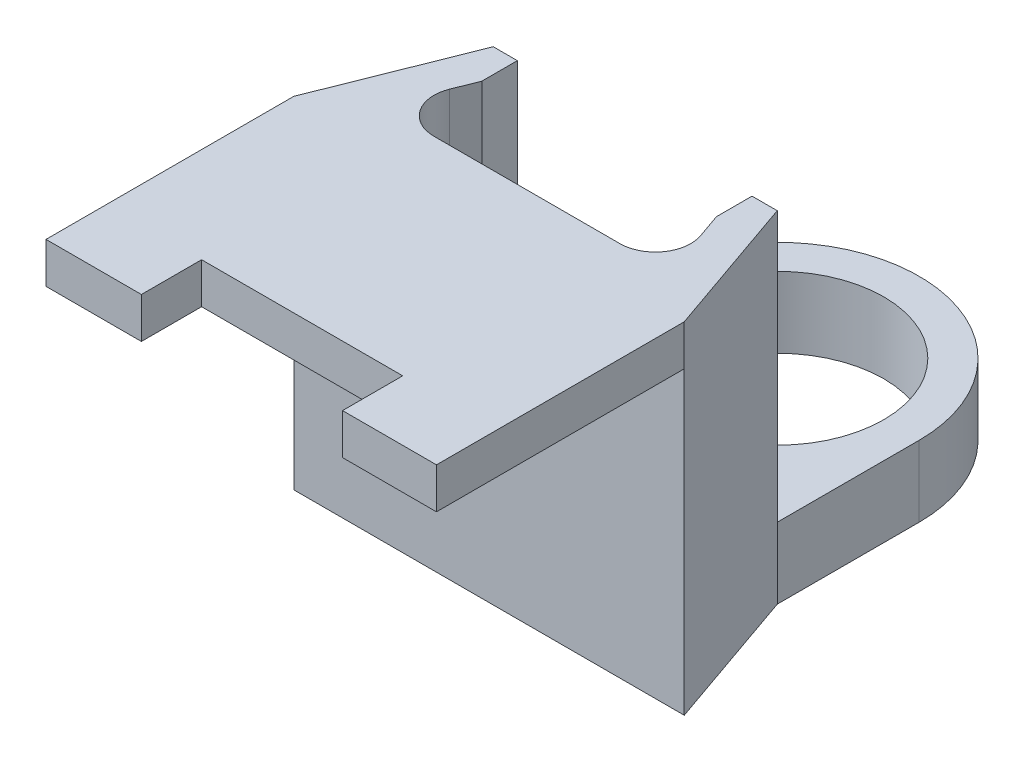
ISO-10303-21;
HEADER;
FILE_DESCRIPTION(('STEP AP214'),'2;1');
FILE_NAME('part.step','',(''),(''),'','','');
FILE_SCHEMA(('AUTOMOTIVE_DESIGN { 1 0 10303 214 1 1 1 1 }'));
ENDSEC;
DATA;
#1=APPLICATION_CONTEXT('core data for automotive mechanical design processes');
#2=APPLICATION_PROTOCOL_DEFINITION('international standard','automotive_design',2000,#1);
#3=PRODUCT_CONTEXT('',#1,'mechanical');
#4=PRODUCT('Part','Part','',(#3));
#5=PRODUCT_RELATED_PRODUCT_CATEGORY('part','',(#4));
#6=PRODUCT_DEFINITION_FORMATION('','',#4);
#7=PRODUCT_DEFINITION_CONTEXT('part definition',#1,'design');
#8=PRODUCT_DEFINITION('design','',#6,#7);
#9=PRODUCT_DEFINITION_SHAPE('','',#8);
#10=(LENGTH_UNIT() NAMED_UNIT(*) SI_UNIT(.MILLI.,.METRE.));
#11=(NAMED_UNIT(*) PLANE_ANGLE_UNIT() SI_UNIT($,.RADIAN.));
#12=(NAMED_UNIT(*) SI_UNIT($,.STERADIAN.) SOLID_ANGLE_UNIT());
#13=UNCERTAINTY_MEASURE_WITH_UNIT(LENGTH_MEASURE(1.E-05),#10,'distance_accuracy_value','');
#14=(GEOMETRIC_REPRESENTATION_CONTEXT(3) GLOBAL_UNCERTAINTY_ASSIGNED_CONTEXT((#13)) GLOBAL_UNIT_ASSIGNED_CONTEXT((#10,
#11,#12)) REPRESENTATION_CONTEXT('',''));
#15=CARTESIAN_POINT('',(0.,0.,0.));
#16=DIRECTION('',(0.,0.,1.));
#17=DIRECTION('',(1.,0.,0.));
#18=AXIS2_PLACEMENT_3D('',#15,#16,#17);
#19=CARTESIAN_POINT('',(47.6155281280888,57.2000000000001,75.));
#20=DIRECTION('',(0.,0.,-1.));
#21=DIRECTION('',(0.,-1.,0.));
#22=AXIS2_PLACEMENT_3D('',#19,#20,#21);
#23=PLANE('',#22);
#24=DIRECTION('',(-1.,0.,0.));
#25=VECTOR('',#24,1.);
#26=CARTESIAN_POINT('',(-27.9999999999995,42.2640722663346,75.));
#27=LINE('',#26,#25);
#28=CARTESIAN_POINT('',(-14.5623007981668,42.2640722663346,75.));
#29=VERTEX_POINT('',#28);
#30=CARTESIAN_POINT('',(-27.9999999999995,42.2640722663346,75.));
#31=VERTEX_POINT('',#30);
#32=EDGE_CURVE('E267',#29,#31,#27,.T.);
#33=ORIENTED_EDGE('',*,*,#32,.F.);
#34=DIRECTION('',(0.,1.,0.));
#35=VECTOR('',#34,1.);
#36=CARTESIAN_POINT('',(-14.5623007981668,-0.001000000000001,75.));
#37=LINE('',#36,#35);
#38=CARTESIAN_POINT('',(-14.5623007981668,48.,75.));
#39=VERTEX_POINT('',#38);
#40=EDGE_CURVE('E249',#29,#39,#37,.T.);
#41=ORIENTED_EDGE('',*,*,#40,.T.);
#42=DIRECTION('',(1.,0.,0.));
#43=VECTOR('',#42,1.);
#44=CARTESIAN_POINT('',(-27.9999999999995,48.,75.));
#45=LINE('',#44,#43);
#46=CARTESIAN_POINT('',(-27.9999999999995,48.,75.));
#47=VERTEX_POINT('',#46);
#48=EDGE_CURVE('E268',#47,#39,#45,.T.);
#49=ORIENTED_EDGE('',*,*,#48,.F.);
#50=DIRECTION('',(0.,1.,0.));
#51=VECTOR('',#50,1.);
#52=CARTESIAN_POINT('',(-27.9999999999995,48.0000000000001,75.));
#53=LINE('',#52,#51);
#54=EDGE_CURVE('E271',#31,#47,#53,.T.);
#55=ORIENTED_EDGE('',*,*,#54,.F.);
#56=EDGE_LOOP('',(#33,#41,#49,#55));
#57=FACE_BOUND('',#56,.T.);
#58=ADVANCED_FACE('F53',(#57),#23,.F.);
#59=CARTESIAN_POINT('',(-20.,48.,20.));
#60=DIRECTION('',(0.,0.,1.));
#61=DIRECTION('',(1.,0.,0.));
#62=AXIS2_PLACEMENT_3D('',#59,#60,#61);
#63=PLANE('',#62);
#64=DIRECTION('',(-1.,0.,0.));
#65=VECTOR('',#64,1.);
#66=CARTESIAN_POINT('',(-20.,10.,20.));
#67=LINE('',#66,#65);
#68=CARTESIAN_POINT('',(20.,10.,20.));
#69=VERTEX_POINT('',#68);
#70=CARTESIAN_POINT('',(16.4467583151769,10.,19.9999999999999));
#71=VERTEX_POINT('',#70);
#72=EDGE_CURVE('E336',#69,#71,#67,.T.);
#73=ORIENTED_EDGE('',*,*,#72,.T.);
#74=DIRECTION('',(0.,1.,0.));
#75=VECTOR('',#74,1.);
#76=CARTESIAN_POINT('',(16.4467583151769,-33.3101923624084,19.9999999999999));
#77=LINE('',#76,#75);
#78=CARTESIAN_POINT('',(16.4467583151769,48.,20.));
#79=VERTEX_POINT('',#78);
#80=EDGE_CURVE('E322',#71,#79,#77,.T.);
#81=ORIENTED_EDGE('',*,*,#80,.T.);
#82=DIRECTION('',(-1.,0.,0.));
#83=VECTOR('',#82,1.);
#84=CARTESIAN_POINT('',(-20.,48.,20.));
#85=LINE('',#84,#83);
#86=CARTESIAN_POINT('',(20.,48.,20.));
#87=VERTEX_POINT('',#86);
#88=EDGE_CURVE('E339',#87,#79,#85,.T.);
#89=ORIENTED_EDGE('',*,*,#88,.F.);
#90=DIRECTION('',(0.,-1.,0.));
#91=VECTOR('',#90,1.);
#92=CARTESIAN_POINT('',(20.,48.,20.));
#93=LINE('',#92,#91);
#94=EDGE_CURVE('E347',#87,#69,#93,.T.);
#95=ORIENTED_EDGE('',*,*,#94,.T.);
#96=EDGE_LOOP('',(#73,#81,#89,#95));
#97=FACE_BOUND('',#96,.T.);
#98=ADVANCED_FACE('F463',(#97),#63,.F.);
#99=CARTESIAN_POINT('',(0.,10.,0.));
#100=DIRECTION('',(0.,-1.,0.));
#101=DIRECTION('',(0.,0.,-1.));
#102=AXIS2_PLACEMENT_3D('',#99,#100,#101);
#103=PLANE('',#102);
#104=CARTESIAN_POINT('',(0.,10.,0.));
#105=DIRECTION('',(0.,1.,0.));
#106=DIRECTION('',(0.,0.,1.));
#107=AXIS2_PLACEMENT_3D('',#104,#105,#106);
#108=CIRCLE('',#107,15.);
#109=CARTESIAN_POINT('',(0.,10.,15.));
#110=VERTEX_POINT('',#109);
#111=EDGE_CURVE('E374',#110,#110,#108,.T.);
#112=ORIENTED_EDGE('',*,*,#111,.F.);
#113=EDGE_LOOP('',(#112));
#114=FACE_BOUND('',#113,.T.);
#115=DIRECTION('',(0.,0.,1.));
#116=VECTOR('',#115,1.);
#117=CARTESIAN_POINT('',(4.91909293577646,10.,0.));
#118=LINE('',#117,#116);
#119=CARTESIAN_POINT('',(4.91909293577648,10.,16.6299617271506));
#120=VERTEX_POINT('',#119);
#121=CARTESIAN_POINT('',(4.91909293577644,10.,25.3001575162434));
#122=VERTEX_POINT('',#121);
#123=EDGE_CURVE('E437',#120,#122,#118,.T.);
#124=ORIENTED_EDGE('',*,*,#123,.T.);
#125=CARTESIAN_POINT('',(14.9190929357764,10.,25.3001575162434));
#126=DIRECTION('',(0.,-1.,0.));
#127=DIRECTION('',(0.,0.,-1.));
#128=AXIS2_PLACEMENT_3D('',#125,#126,#127);
#129=CIRCLE('',#128,10.);
#130=CARTESIAN_POINT('',(12.9283425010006,10.,35.1));
#131=VERTEX_POINT('',#130);
#132=EDGE_CURVE('E418',#122,#131,#129,.F.);
#133=ORIENTED_EDGE('',*,*,#132,.T.);
#134=CARTESIAN_POINT('',(12.9283425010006,10.,30.1));
#135=DIRECTION('',(0.,-1.,0.));
#136=DIRECTION('',(0.,0.,-1.));
#137=AXIS2_PLACEMENT_3D('',#134,#135,#136);
#138=CIRCLE('',#137,5.);
#139=CARTESIAN_POINT('',(17.650192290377,10.,28.455574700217));
#140=VERTEX_POINT('',#139);
#141=EDGE_CURVE('E407',#131,#140,#138,.F.);
#142=ORIENTED_EDGE('',*,*,#141,.T.);
#143=DIRECTION('',(-0.328885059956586,0.,-0.944369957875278));
#144=VECTOR('',#143,1.);
#145=CARTESIAN_POINT('',(19.9641712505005,10.,35.1));
#146=LINE('',#145,#144);
#147=CARTESIAN_POINT('',(16.4467583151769,10.,25.));
#148=VERTEX_POINT('',#147);
#149=EDGE_CURVE('E300',#140,#148,#146,.T.);
#150=ORIENTED_EDGE('',*,*,#149,.T.);
#151=DIRECTION('',(0.,0.,-1.));
#152=VECTOR('',#151,1.);
#153=CARTESIAN_POINT('',(16.4467583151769,10.,25.));
#154=LINE('',#153,#152);
#155=EDGE_CURVE('E319',#148,#71,#154,.T.);
#156=ORIENTED_EDGE('',*,*,#155,.T.);
#157=ORIENTED_EDGE('',*,*,#72,.F.);
#158=DIRECTION('',(0.,0.,-1.));
#159=VECTOR('',#158,1.);
#160=CARTESIAN_POINT('',(20.,10.,-20.));
#161=LINE('',#160,#159);
#162=CARTESIAN_POINT('',(20.,10.,0.));
#163=VERTEX_POINT('',#162);
#164=EDGE_CURVE('E383',#69,#163,#161,.T.);
#165=ORIENTED_EDGE('',*,*,#164,.T.);
#166=CARTESIAN_POINT('',(0.,10.,0.));
#167=DIRECTION('',(0.,1.,0.));
#168=DIRECTION('',(0.,0.,1.));
#169=AXIS2_PLACEMENT_3D('',#166,#167,#168);
#170=CIRCLE('',#169,20.);
#171=CARTESIAN_POINT('',(-20.,10.,0.));
#172=VERTEX_POINT('',#171);
#173=EDGE_CURVE('E366',#163,#172,#170,.T.);
#174=ORIENTED_EDGE('',*,*,#173,.T.);
#175=DIRECTION('',(0.,0.,1.));
#176=VECTOR('',#175,1.);
#177=CARTESIAN_POINT('',(-20.,10.,20.));
#178=LINE('',#177,#176);
#179=CARTESIAN_POINT('',(-20.,10.,20.));
#180=VERTEX_POINT('',#179);
#181=EDGE_CURVE('E380',#172,#180,#178,.T.);
#182=ORIENTED_EDGE('',*,*,#181,.T.);
#183=CARTESIAN_POINT('',(-16.608572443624,10.,20.));
#184=VERTEX_POINT('',#183);
#185=EDGE_CURVE('E313',#184,#180,#67,.T.);
#186=ORIENTED_EDGE('',*,*,#185,.F.);
#187=DIRECTION('',(0.,0.,1.));
#188=VECTOR('',#187,1.);
#189=CARTESIAN_POINT('',(-16.608572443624,10.,25.));
#190=LINE('',#189,#188);
#191=CARTESIAN_POINT('',(-16.608572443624,10.,25.));
#192=VERTEX_POINT('',#191);
#193=EDGE_CURVE('E315',#184,#192,#190,.T.);
#194=ORIENTED_EDGE('',*,*,#193,.T.);
#195=DIRECTION('',(-0.369796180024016,0.,0.929112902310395));
#196=VECTOR('',#195,1.);
#197=CARTESIAN_POINT('',(-16.608572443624,10.,25.));
#198=LINE('',#197,#196);
#199=CARTESIAN_POINT('',(-17.9025103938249,10.,28.2510190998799));
#200=VERTEX_POINT('',#199);
#201=EDGE_CURVE('E310',#192,#200,#198,.T.);
#202=ORIENTED_EDGE('',*,*,#201,.T.);
#203=CARTESIAN_POINT('',(-13.2569458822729,10.,30.1));
#204=DIRECTION('',(0.,-1.,0.));
#205=DIRECTION('',(0.,0.,-1.));
#206=AXIS2_PLACEMENT_3D('',#203,#204,#205);
#207=CIRCLE('',#206,5.);
#208=CARTESIAN_POINT('',(-13.2569458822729,10.,35.1));
#209=VERTEX_POINT('',#208);
#210=EDGE_CURVE('E405',#200,#209,#207,.F.);
#211=ORIENTED_EDGE('',*,*,#210,.T.);
#212=CARTESIAN_POINT('',(-15.0809070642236,10.,25.2677487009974));
#213=DIRECTION('',(0.,-1.,0.));
#214=DIRECTION('',(0.,0.,-1.));
#215=AXIS2_PLACEMENT_3D('',#212,#213,#214);
#216=CIRCLE('',#215,10.);
#217=CARTESIAN_POINT('',(-5.08090706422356,10.,25.2677487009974));
#218=VERTEX_POINT('',#217);
#219=EDGE_CURVE('E74',#209,#218,#216,.F.);
#220=ORIENTED_EDGE('',*,*,#219,.T.);
#221=DIRECTION('',(0.,0.,1.));
#222=VECTOR('',#221,1.);
#223=CARTESIAN_POINT('',(-5.08090706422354,10.,0.));
#224=LINE('',#223,#222);
#225=CARTESIAN_POINT('',(-5.08090706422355,10.,16.6299617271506));
#226=VERTEX_POINT('',#225);
#227=EDGE_CURVE('E438',#226,#218,#224,.T.);
#228=ORIENTED_EDGE('',*,*,#227,.F.);
#229=DIRECTION('',(1.,0.,0.));
#230=VECTOR('',#229,1.);
#231=CARTESIAN_POINT('',(0.,10.,16.6299617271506));
#232=LINE('',#231,#230);
#233=EDGE_CURVE('E245',#226,#120,#232,.T.);
#234=ORIENTED_EDGE('',*,*,#233,.T.);
#235=EDGE_LOOP('',(#124,#133,#142,#150,#156,#157,#165,#174,#182,#186,#194,#202,#211,#220,#228,#234));
#236=FACE_BOUND('',#235,.T.);
#237=ADVANCED_FACE('F444',(#114,#236),#103,.F.);
#238=CARTESIAN_POINT('',(0.,0.,0.));
#239=DIRECTION('',(0.,-1.,0.));
#240=DIRECTION('',(0.,0.,-1.));
#241=AXIS2_PLACEMENT_3D('',#238,#239,#240);
#242=PLANE('',#241);
#243=DIRECTION('',(-0.328885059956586,0.,-0.944369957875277));
#244=VECTOR('',#243,1.);
#245=CARTESIAN_POINT('',(27.0000000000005,0.,40.1));
#246=LINE('',#245,#244);
#247=CARTESIAN_POINT('',(27.0000000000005,0.,40.1));
#248=VERTEX_POINT('',#247);
#249=CARTESIAN_POINT('',(20.,0.,20.));
#250=VERTEX_POINT('',#249);
#251=EDGE_CURVE('E355',#248,#250,#246,.T.);
#252=ORIENTED_EDGE('',*,*,#251,.F.);
#253=DIRECTION('',(1.,0.,0.));
#254=VECTOR('',#253,1.);
#255=CARTESIAN_POINT('',(-27.9999999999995,0.,40.1));
#256=LINE('',#255,#254);
#257=CARTESIAN_POINT('',(-27.9999999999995,0.,40.1));
#258=VERTEX_POINT('',#257);
#259=EDGE_CURVE('E353',#258,#248,#256,.T.);
#260=ORIENTED_EDGE('',*,*,#259,.F.);
#261=DIRECTION('',(-0.369796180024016,0.,0.929112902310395));
#262=VECTOR('',#261,1.);
#263=CARTESIAN_POINT('',(-20.,0.,20.));
#264=LINE('',#263,#262);
#265=CARTESIAN_POINT('',(-20.,0.,20.));
#266=VERTEX_POINT('',#265);
#267=EDGE_CURVE('E350',#266,#258,#264,.T.);
#268=ORIENTED_EDGE('',*,*,#267,.F.);
#269=DIRECTION('',(0.,0.,1.));
#270=VECTOR('',#269,1.);
#271=CARTESIAN_POINT('',(-20.,0.,20.));
#272=LINE('',#271,#270);
#273=CARTESIAN_POINT('',(-20.,0.,0.));
#274=VERTEX_POINT('',#273);
#275=EDGE_CURVE('E377',#274,#266,#272,.T.);
#276=ORIENTED_EDGE('',*,*,#275,.F.);
#277=CARTESIAN_POINT('',(0.,0.,0.));
#278=DIRECTION('',(0.,1.,0.));
#279=DIRECTION('',(0.,0.,1.));
#280=AXIS2_PLACEMENT_3D('',#277,#278,#279);
#281=CIRCLE('',#280,20.);
#282=CARTESIAN_POINT('',(20.,0.,0.));
#283=VERTEX_POINT('',#282);
#284=EDGE_CURVE('E367',#283,#274,#281,.T.);
#285=ORIENTED_EDGE('',*,*,#284,.F.);
#286=DIRECTION('',(0.,0.,-1.));
#287=VECTOR('',#286,1.);
#288=CARTESIAN_POINT('',(20.,0.,-20.));
#289=LINE('',#288,#287);
#290=EDGE_CURVE('E384',#250,#283,#289,.T.);
#291=ORIENTED_EDGE('',*,*,#290,.F.);
#292=EDGE_LOOP('',(#252,#260,#268,#276,#285,#291));
#293=FACE_BOUND('',#292,.T.);
#294=CARTESIAN_POINT('',(0.,0.,0.));
#295=DIRECTION('',(0.,1.,0.));
#296=DIRECTION('',(0.,0.,1.));
#297=AXIS2_PLACEMENT_3D('',#294,#295,#296);
#298=CIRCLE('',#297,15.);
#299=CARTESIAN_POINT('',(0.,0.,15.));
#300=VERTEX_POINT('',#299);
#301=EDGE_CURVE('E373',#300,#300,#298,.T.);
#302=ORIENTED_EDGE('',*,*,#301,.T.);
#303=EDGE_LOOP('',(#302));
#304=FACE_BOUND('',#303,.T.);
#305=ADVANCED_FACE('F477',(#293,#304),#242,.T.);
#306=CARTESIAN_POINT('',(-20.,10.,20.));
#307=DIRECTION('',(1.,0.,0.));
#308=DIRECTION('',(0.,0.,-1.));
#309=AXIS2_PLACEMENT_3D('',#306,#307,#308);
#310=PLANE('',#309);
#311=DIRECTION('',(0.,1.,0.));
#312=VECTOR('',#311,1.);
#313=CARTESIAN_POINT('',(-20.,0.,0.));
#314=LINE('',#313,#312);
#315=EDGE_CURVE('E361',#274,#172,#314,.T.);
#316=ORIENTED_EDGE('',*,*,#315,.F.);
#317=ORIENTED_EDGE('',*,*,#275,.T.);
#318=DIRECTION('',(0.,-1.,0.));
#319=VECTOR('',#318,1.);
#320=CARTESIAN_POINT('',(-20.,10.,20.));
#321=LINE('',#320,#319);
#322=EDGE_CURVE('E392',#180,#266,#321,.T.);
#323=ORIENTED_EDGE('',*,*,#322,.F.);
#324=ORIENTED_EDGE('',*,*,#181,.F.);
#325=EDGE_LOOP('',(#316,#317,#323,#324));
#326=FACE_BOUND('',#325,.T.);
#327=ADVANCED_FACE('F487',(#326),#310,.F.);
#328=CARTESIAN_POINT('',(20.,10.,-20.));
#329=DIRECTION('',(-1.,0.,0.));
#330=DIRECTION('',(0.,0.,1.));
#331=AXIS2_PLACEMENT_3D('',#328,#329,#330);
#332=PLANE('',#331);
#333=ORIENTED_EDGE('',*,*,#290,.T.);
#334=DIRECTION('',(0.,1.,0.));
#335=VECTOR('',#334,1.);
#336=CARTESIAN_POINT('',(20.,0.,0.));
#337=LINE('',#336,#335);
#338=EDGE_CURVE('E369',#283,#163,#337,.T.);
#339=ORIENTED_EDGE('',*,*,#338,.T.);
#340=ORIENTED_EDGE('',*,*,#164,.F.);
#341=DIRECTION('',(0.,-1.,0.));
#342=VECTOR('',#341,1.);
#343=CARTESIAN_POINT('',(20.,10.,20.));
#344=LINE('',#343,#342);
#345=EDGE_CURVE('E387',#69,#250,#344,.T.);
#346=ORIENTED_EDGE('',*,*,#345,.T.);
#347=EDGE_LOOP('',(#333,#339,#340,#346));
#348=FACE_BOUND('',#347,.T.);
#349=ADVANCED_FACE('F468',(#348),#332,.F.);
#350=CARTESIAN_POINT('',(0.,10.,0.));
#351=DIRECTION('',(0.,-1.,0.));
#352=DIRECTION('',(0.,0.,-1.));
#353=AXIS2_PLACEMENT_3D('',#350,#351,#352);
#354=CYLINDRICAL_SURFACE('',#353,15.);
#355=ORIENTED_EDGE('',*,*,#301,.F.);
#356=EDGE_LOOP('',(#355));
#357=FACE_BOUND('',#356,.T.);
#358=ORIENTED_EDGE('',*,*,#111,.T.);
#359=EDGE_LOOP('',(#358));
#360=FACE_BOUND('',#359,.T.);
#361=ADVANCED_FACE('F585',(#357,#360),#354,.F.);
#362=CARTESIAN_POINT('',(0.,0.,0.));
#363=DIRECTION('',(0.,1.,0.));
#364=DIRECTION('',(0.,0.,1.));
#365=AXIS2_PLACEMENT_3D('',#362,#363,#364);
#366=CYLINDRICAL_SURFACE('',#365,20.);
#367=ORIENTED_EDGE('',*,*,#173,.F.);
#368=ORIENTED_EDGE('',*,*,#338,.F.);
#369=ORIENTED_EDGE('',*,*,#284,.T.);
#370=ORIENTED_EDGE('',*,*,#315,.T.);
#371=EDGE_LOOP('',(#367,#368,#369,#370));
#372=FACE_BOUND('',#371,.T.);
#373=ADVANCED_FACE('F484',(#372),#366,.T.);
#374=CARTESIAN_POINT('',(-20.,0.,20.));
#375=DIRECTION('',(-0.929112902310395,0.,-0.369796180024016));
#376=DIRECTION('',(-0.369796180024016,0.,0.929112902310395));
#377=AXIS2_PLACEMENT_3D('',#374,#375,#376);
#378=PLANE('',#377);
#379=DIRECTION('',(0.,1.,0.));
#380=VECTOR('',#379,1.);
#381=CARTESIAN_POINT('',(-27.9999999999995,0.,40.1));
#382=LINE('',#381,#380);
#383=CARTESIAN_POINT('',(-27.9999999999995,42.2640722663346,40.1));
#384=VERTEX_POINT('',#383);
#385=EDGE_CURVE('E358',#258,#384,#382,.T.);
#386=ORIENTED_EDGE('',*,*,#385,.T.);
#387=DIRECTION('',(0.,-1.,0.));
#388=VECTOR('',#387,1.);
#389=CARTESIAN_POINT('',(-27.9999999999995,48.,40.1));
#390=LINE('',#389,#388);
#391=CARTESIAN_POINT('',(-27.9999999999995,48.,40.1));
#392=VERTEX_POINT('',#391);
#393=EDGE_CURVE('E263',#392,#384,#390,.T.);
#394=ORIENTED_EDGE('',*,*,#393,.F.);
#395=DIRECTION('',(-0.369796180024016,0.,0.929112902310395));
#396=VECTOR('',#395,1.);
#397=CARTESIAN_POINT('',(-27.9999999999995,48.,40.1));
#398=LINE('',#397,#396);
#399=CARTESIAN_POINT('',(-20.,48.,20.));
#400=VERTEX_POINT('',#399);
#401=EDGE_CURVE('E332',#400,#392,#398,.T.);
#402=ORIENTED_EDGE('',*,*,#401,.F.);
#403=DIRECTION('',(0.,-1.,0.));
#404=VECTOR('',#403,1.);
#405=CARTESIAN_POINT('',(-20.,48.,20.));
#406=LINE('',#405,#404);
#407=EDGE_CURVE('E342',#400,#180,#406,.T.);
#408=ORIENTED_EDGE('',*,*,#407,.T.);
#409=ORIENTED_EDGE('',*,*,#322,.T.);
#410=ORIENTED_EDGE('',*,*,#267,.T.);
#411=EDGE_LOOP('',(#386,#394,#402,#408,#409,#410));
#412=FACE_BOUND('',#411,.T.);
#413=ADVANCED_FACE('F493',(#412),#378,.T.);
#414=CARTESIAN_POINT('',(27.0000000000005,0.,40.1));
#415=DIRECTION('',(0.944369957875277,0.,-0.328885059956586));
#416=DIRECTION('',(-0.328885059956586,0.,-0.944369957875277));
#417=AXIS2_PLACEMENT_3D('',#414,#415,#416);
#418=PLANE('',#417);
#419=ORIENTED_EDGE('',*,*,#345,.F.);
#420=ORIENTED_EDGE('',*,*,#94,.F.);
#421=DIRECTION('',(-0.328885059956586,0.,-0.944369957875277));
#422=VECTOR('',#421,1.);
#423=CARTESIAN_POINT('',(20.,48.,20.));
#424=LINE('',#423,#422);
#425=CARTESIAN_POINT('',(27.0000000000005,48.,40.1));
#426=VERTEX_POINT('',#425);
#427=EDGE_CURVE('E335',#426,#87,#424,.T.);
#428=ORIENTED_EDGE('',*,*,#427,.F.);
#429=DIRECTION('',(0.,1.,0.));
#430=VECTOR('',#429,1.);
#431=CARTESIAN_POINT('',(27.0000000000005,48.,40.1));
#432=LINE('',#431,#430);
#433=CARTESIAN_POINT('',(27.0000000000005,42.2640722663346,40.1));
#434=VERTEX_POINT('',#433);
#435=EDGE_CURVE('E280',#434,#426,#432,.T.);
#436=ORIENTED_EDGE('',*,*,#435,.F.);
#437=DIRECTION('',(0.,1.,0.));
#438=VECTOR('',#437,1.);
#439=CARTESIAN_POINT('',(27.0000000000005,0.,40.1));
#440=LINE('',#439,#438);
#441=EDGE_CURVE('E359',#248,#434,#440,.T.);
#442=ORIENTED_EDGE('',*,*,#441,.F.);
#443=ORIENTED_EDGE('',*,*,#251,.T.);
#444=EDGE_LOOP('',(#419,#420,#428,#436,#442,#443));
#445=FACE_BOUND('',#444,.T.);
#446=ADVANCED_FACE('F471',(#445),#418,.T.);
#447=CARTESIAN_POINT('',(-27.9999999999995,0.,40.1));
#448=DIRECTION('',(0.,0.,1.));
#449=DIRECTION('',(1.,0.,0.));
#450=AXIS2_PLACEMENT_3D('',#447,#448,#449);
#451=PLANE('',#450);
#452=ORIENTED_EDGE('',*,*,#259,.T.);
#453=ORIENTED_EDGE('',*,*,#441,.T.);
#454=DIRECTION('',(1.,0.,0.));
#455=VECTOR('',#454,1.);
#456=CARTESIAN_POINT('',(-27.9999999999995,42.2640722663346,40.1));
#457=LINE('',#456,#455);
#458=EDGE_CURVE('E277',#384,#434,#457,.T.);
#459=ORIENTED_EDGE('',*,*,#458,.F.);
#460=ORIENTED_EDGE('',*,*,#385,.F.);
#461=EDGE_LOOP('',(#452,#453,#459,#460));
#462=FACE_BOUND('',#461,.T.);
#463=ADVANCED_FACE('F576',(#462),#451,.T.);
#464=CARTESIAN_POINT('',(-16.608572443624,48.,20.));
#465=VERTEX_POINT('',#464);
#466=EDGE_CURVE('E338',#465,#400,#85,.T.);
#467=ORIENTED_EDGE('',*,*,#466,.F.);
#468=DIRECTION('',(0.,1.,0.));
#469=VECTOR('',#468,1.);
#470=CARTESIAN_POINT('',(-16.608572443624,-33.3101923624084,20.));
#471=LINE('',#470,#469);
#472=EDGE_CURVE('E318',#184,#465,#471,.T.);
#473=ORIENTED_EDGE('',*,*,#472,.F.);
#474=ORIENTED_EDGE('',*,*,#185,.T.);
#475=ORIENTED_EDGE('',*,*,#407,.F.);
#476=EDGE_LOOP('',(#467,#473,#474,#475));
#477=FACE_BOUND('',#476,.T.);
#478=ADVANCED_FACE('F496',(#477),#63,.F.);
#479=CARTESIAN_POINT('',(0.,48.,0.));
#480=DIRECTION('',(0.,-1.,0.));
#481=DIRECTION('',(0.,0.,-1.));
#482=AXIS2_PLACEMENT_3D('',#479,#480,#481);
#483=PLANE('',#482);
#484=DIRECTION('',(0.,0.,1.));
#485=VECTOR('',#484,1.);
#486=CARTESIAN_POINT('',(-14.5623007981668,48.,75.));
#487=LINE('',#486,#485);
#488=CARTESIAN_POINT('',(-14.5623007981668,48.,66.5213249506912));
#489=VERTEX_POINT('',#488);
#490=EDGE_CURVE('E253',#489,#39,#487,.T.);
#491=ORIENTED_EDGE('',*,*,#490,.F.);
#492=DIRECTION('',(-1.,0.,0.));
#493=VECTOR('',#492,1.);
#494=CARTESIAN_POINT('',(13.7662873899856,48.,66.5213249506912));
#495=LINE('',#494,#493);
#496=CARTESIAN_POINT('',(13.7662873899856,48.,66.5213249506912));
#497=VERTEX_POINT('',#496);
#498=EDGE_CURVE('E242',#497,#489,#495,.T.);
#499=ORIENTED_EDGE('',*,*,#498,.F.);
#500=DIRECTION('',(0.,0.,-1.));
#501=VECTOR('',#500,1.);
#502=CARTESIAN_POINT('',(13.7662873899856,48.,59.6896338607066));
#503=LINE('',#502,#501);
#504=CARTESIAN_POINT('',(13.7662873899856,48.,75.));
#505=VERTEX_POINT('',#504);
#506=EDGE_CURVE('E250',#505,#497,#503,.T.);
#507=ORIENTED_EDGE('',*,*,#506,.F.);
#508=CARTESIAN_POINT('',(27.0000000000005,48.,75.));
#509=VERTEX_POINT('',#508);
#510=EDGE_CURVE('E295',#505,#509,#45,.T.);
#511=ORIENTED_EDGE('',*,*,#510,.T.);
#512=DIRECTION('',(0.,0.,-1.));
#513=VECTOR('',#512,1.);
#514=CARTESIAN_POINT('',(27.0000000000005,48.,130.298289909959));
#515=LINE('',#514,#513);
#516=EDGE_CURVE('E286',#509,#426,#515,.T.);
#517=ORIENTED_EDGE('',*,*,#516,.T.);
#518=ORIENTED_EDGE('',*,*,#427,.T.);
#519=ORIENTED_EDGE('',*,*,#88,.T.);
#520=DIRECTION('',(0.,0.,-1.));
#521=VECTOR('',#520,1.);
#522=CARTESIAN_POINT('',(16.4467583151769,48.,25.));
#523=LINE('',#522,#521);
#524=CARTESIAN_POINT('',(16.4467583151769,48.,25.));
#525=VERTEX_POINT('',#524);
#526=EDGE_CURVE('E301',#525,#79,#523,.T.);
#527=ORIENTED_EDGE('',*,*,#526,.F.);
#528=DIRECTION('',(-0.328885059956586,0.,-0.944369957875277));
#529=VECTOR('',#528,1.);
#530=CARTESIAN_POINT('',(19.9641712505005,48.,35.1));
#531=LINE('',#530,#529);
#532=CARTESIAN_POINT('',(17.6501922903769,48.,28.4555747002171));
#533=VERTEX_POINT('',#532);
#534=EDGE_CURVE('E303',#533,#525,#531,.T.);
#535=ORIENTED_EDGE('',*,*,#534,.F.);
#536=CARTESIAN_POINT('',(12.9283425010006,48.,30.1));
#537=DIRECTION('',(0.,-1.,0.));
#538=DIRECTION('',(0.,0.,-1.));
#539=AXIS2_PLACEMENT_3D('',#536,#537,#538);
#540=CIRCLE('',#539,5.);
#541=CARTESIAN_POINT('',(12.9283425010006,48.,35.1));
#542=VERTEX_POINT('',#541);
#543=EDGE_CURVE('E411',#533,#542,#540,.T.);
#544=ORIENTED_EDGE('',*,*,#543,.T.);
#545=DIRECTION('',(1.,0.,0.));
#546=VECTOR('',#545,1.);
#547=CARTESIAN_POINT('',(-20.6284729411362,48.,35.1));
#548=LINE('',#547,#546);
#549=CARTESIAN_POINT('',(-13.256945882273,48.,35.1));
#550=VERTEX_POINT('',#549);
#551=EDGE_CURVE('E305',#550,#542,#548,.T.);
#552=ORIENTED_EDGE('',*,*,#551,.F.);
#553=CARTESIAN_POINT('',(-13.2569458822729,48.,30.1));
#554=DIRECTION('',(0.,-1.,0.));
#555=DIRECTION('',(0.,0.,-1.));
#556=AXIS2_PLACEMENT_3D('',#553,#554,#555);
#557=CIRCLE('',#556,5.);
#558=CARTESIAN_POINT('',(-17.9025103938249,48.,28.2510190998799));
#559=VERTEX_POINT('',#558);
#560=EDGE_CURVE('E413',#550,#559,#557,.T.);
#561=ORIENTED_EDGE('',*,*,#560,.T.);
#562=DIRECTION('',(-0.369796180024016,0.,0.929112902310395));
#563=VECTOR('',#562,1.);
#564=CARTESIAN_POINT('',(-16.608572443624,48.,25.));
#565=LINE('',#564,#563);
#566=CARTESIAN_POINT('',(-16.608572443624,48.,25.));
#567=VERTEX_POINT('',#566);
#568=EDGE_CURVE('E274',#567,#559,#565,.T.);
#569=ORIENTED_EDGE('',*,*,#568,.F.);
#570=DIRECTION('',(0.,0.,1.));
#571=VECTOR('',#570,1.);
#572=CARTESIAN_POINT('',(-16.608572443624,48.,25.));
#573=LINE('',#572,#571);
#574=EDGE_CURVE('E298',#465,#567,#573,.T.);
#575=ORIENTED_EDGE('',*,*,#574,.F.);
#576=ORIENTED_EDGE('',*,*,#466,.T.);
#577=ORIENTED_EDGE('',*,*,#401,.T.);
#578=DIRECTION('',(0.,0.,-1.));
#579=VECTOR('',#578,1.);
#580=CARTESIAN_POINT('',(-27.9999999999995,48.,130.298289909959));
#581=LINE('',#580,#579);
#582=EDGE_CURVE('E283',#47,#392,#581,.T.);
#583=ORIENTED_EDGE('',*,*,#582,.F.);
#584=ORIENTED_EDGE('',*,*,#48,.T.);
#585=EDGE_LOOP('',(#491,#499,#507,#511,#517,#518,#519,#527,#535,#544,#552,#561,#569,#575,#576,
#577,#583,#584));
#586=FACE_BOUND('',#585,.T.);
#587=ADVANCED_FACE('F456',(#586),#483,.F.);
#588=CARTESIAN_POINT('',(-20.6284729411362,-33.3101923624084,35.1));
#589=DIRECTION('',(0.,0.,1.));
#590=DIRECTION('',(0.,-1.,0.));
#591=AXIS2_PLACEMENT_3D('',#588,#589,#590);
#592=PLANE('',#591);
#593=DIRECTION('',(0.,1.,0.));
#594=VECTOR('',#593,1.);
#595=CARTESIAN_POINT('',(12.9283425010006,9.99999999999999,35.1));
#596=LINE('',#595,#594);
#597=CARTESIAN_POINT('',(12.9283425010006,26.8837716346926,35.1));
#598=VERTEX_POINT('',#597);
#599=EDGE_CURVE('E402',#542,#598,#596,.F.);
#600=ORIENTED_EDGE('',*,*,#599,.T.);
#601=DIRECTION('',(-1.,0.,0.));
#602=VECTOR('',#601,1.);
#603=CARTESIAN_POINT('',(-20.6284729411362,26.8837716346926,35.1));
#604=LINE('',#603,#602);
#605=CARTESIAN_POINT('',(-13.2569458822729,26.8837716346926,35.1));
#606=VERTEX_POINT('',#605);
#607=EDGE_CURVE('E428',#598,#606,#604,.T.);
#608=ORIENTED_EDGE('',*,*,#607,.T.);
#609=DIRECTION('',(0.,1.,0.));
#610=VECTOR('',#609,1.);
#611=CARTESIAN_POINT('',(-13.2569458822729,48.,35.1));
#612=LINE('',#611,#610);
#613=EDGE_CURVE('E398',#606,#550,#612,.T.);
#614=ORIENTED_EDGE('',*,*,#613,.T.);
#615=ORIENTED_EDGE('',*,*,#551,.T.);
#616=EDGE_LOOP('',(#600,#608,#614,#615));
#617=FACE_BOUND('',#616,.T.);
#618=ADVANCED_FACE('F569',(#617),#592,.F.);
#619=CARTESIAN_POINT('',(19.9641712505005,-33.3101923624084,35.1));
#620=DIRECTION('',(0.944369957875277,0.,-0.328885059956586));
#621=DIRECTION('',(-0.328885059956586,0.,-0.944369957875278));
#622=AXIS2_PLACEMENT_3D('',#619,#620,#621);
#623=PLANE('',#622);
#624=ORIENTED_EDGE('',*,*,#149,.F.);
#625=DIRECTION('',(0.,1.,0.));
#626=VECTOR('',#625,1.);
#627=CARTESIAN_POINT('',(17.650192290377,48.,28.4555747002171));
#628=LINE('',#627,#626);
#629=EDGE_CURVE('E395',#140,#533,#628,.T.);
#630=ORIENTED_EDGE('',*,*,#629,.T.);
#631=ORIENTED_EDGE('',*,*,#534,.T.);
#632=DIRECTION('',(0.,1.,0.));
#633=VECTOR('',#632,1.);
#634=CARTESIAN_POINT('',(16.4467583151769,-33.3101923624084,25.));
#635=LINE('',#634,#633);
#636=EDGE_CURVE('E323',#148,#525,#635,.T.);
#637=ORIENTED_EDGE('',*,*,#636,.F.);
#638=EDGE_LOOP('',(#624,#630,#631,#637));
#639=FACE_BOUND('',#638,.T.);
#640=ADVANCED_FACE('F452',(#639),#623,.F.);
#641=CARTESIAN_POINT('',(16.4467583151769,-33.3101923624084,25.));
#642=DIRECTION('',(1.,0.,0.));
#643=DIRECTION('',(0.,0.,-1.));
#644=AXIS2_PLACEMENT_3D('',#641,#642,#643);
#645=PLANE('',#644);
#646=ORIENTED_EDGE('',*,*,#636,.T.);
#647=ORIENTED_EDGE('',*,*,#526,.T.);
#648=ORIENTED_EDGE('',*,*,#80,.F.);
#649=ORIENTED_EDGE('',*,*,#155,.F.);
#650=EDGE_LOOP('',(#646,#647,#648,#649));
#651=FACE_BOUND('',#650,.T.);
#652=ADVANCED_FACE('F460',(#651),#645,.F.);
#653=CARTESIAN_POINT('',(-16.608572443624,-33.3101923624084,25.));
#654=DIRECTION('',(-1.,0.,0.));
#655=DIRECTION('',(0.,0.,1.));
#656=AXIS2_PLACEMENT_3D('',#653,#654,#655);
#657=PLANE('',#656);
#658=ORIENTED_EDGE('',*,*,#472,.T.);
#659=ORIENTED_EDGE('',*,*,#574,.T.);
#660=DIRECTION('',(0.,1.,0.));
#661=VECTOR('',#660,1.);
#662=CARTESIAN_POINT('',(-16.608572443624,-33.3101923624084,25.));
#663=LINE('',#662,#661);
#664=EDGE_CURVE('E314',#192,#567,#663,.T.);
#665=ORIENTED_EDGE('',*,*,#664,.F.);
#666=ORIENTED_EDGE('',*,*,#193,.F.);
#667=EDGE_LOOP('',(#658,#659,#665,#666));
#668=FACE_BOUND('',#667,.T.);
#669=ADVANCED_FACE('F500',(#668),#657,.F.);
#670=CARTESIAN_POINT('',(-16.608572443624,-33.3101923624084,25.));
#671=DIRECTION('',(-0.929112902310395,0.,-0.369796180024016));
#672=DIRECTION('',(-0.369796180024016,0.,0.929112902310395));
#673=AXIS2_PLACEMENT_3D('',#670,#671,#672);
#674=PLANE('',#673);
#675=ORIENTED_EDGE('',*,*,#568,.T.);
#676=DIRECTION('',(0.,1.,0.));
#677=VECTOR('',#676,1.);
#678=CARTESIAN_POINT('',(-17.9025103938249,9.99999999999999,28.2510190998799));
#679=LINE('',#678,#677);
#680=EDGE_CURVE('E409',#559,#200,#679,.F.);
#681=ORIENTED_EDGE('',*,*,#680,.T.);
#682=ORIENTED_EDGE('',*,*,#201,.F.);
#683=ORIENTED_EDGE('',*,*,#664,.T.);
#684=EDGE_LOOP('',(#675,#681,#682,#683));
#685=FACE_BOUND('',#684,.T.);
#686=ADVANCED_FACE('F506',(#685),#674,.F.);
#687=CARTESIAN_POINT('',(27.0000000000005,48.,130.298289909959));
#688=DIRECTION('',(-1.,0.,0.));
#689=DIRECTION('',(0.,0.,1.));
#690=AXIS2_PLACEMENT_3D('',#687,#688,#689);
#691=PLANE('',#690);
#692=ORIENTED_EDGE('',*,*,#516,.F.);
#693=DIRECTION('',(0.,-1.,0.));
#694=VECTOR('',#693,1.);
#695=CARTESIAN_POINT('',(27.0000000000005,48.0000000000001,75.));
#696=LINE('',#695,#694);
#697=CARTESIAN_POINT('',(27.0000000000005,42.2640722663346,75.));
#698=VERTEX_POINT('',#697);
#699=EDGE_CURVE('E264',#509,#698,#696,.T.);
#700=ORIENTED_EDGE('',*,*,#699,.T.);
#701=DIRECTION('',(0.,0.,-1.));
#702=VECTOR('',#701,1.);
#703=CARTESIAN_POINT('',(27.0000000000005,42.2640722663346,130.298289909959));
#704=LINE('',#703,#702);
#705=EDGE_CURVE('E289',#698,#434,#704,.T.);
#706=ORIENTED_EDGE('',*,*,#705,.T.);
#707=ORIENTED_EDGE('',*,*,#435,.T.);
#708=EDGE_LOOP('',(#692,#700,#706,#707));
#709=FACE_BOUND('',#708,.T.);
#710=ADVANCED_FACE('F532',(#709),#691,.F.);
#711=CARTESIAN_POINT('',(-27.9999999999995,42.2640722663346,130.298289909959));
#712=DIRECTION('',(0.,1.,0.));
#713=DIRECTION('',(0.,0.,1.));
#714=AXIS2_PLACEMENT_3D('',#711,#712,#713);
#715=PLANE('',#714);
#716=DIRECTION('',(0.,0.,1.));
#717=VECTOR('',#716,1.);
#718=CARTESIAN_POINT('',(13.7662873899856,42.2640722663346,59.6896338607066));
#719=LINE('',#718,#717);
#720=CARTESIAN_POINT('',(13.7662873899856,42.2640722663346,66.5213249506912));
#721=VERTEX_POINT('',#720);
#722=CARTESIAN_POINT('',(13.7662873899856,42.2640722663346,75.));
#723=VERTEX_POINT('',#722);
#724=EDGE_CURVE('E233',#721,#723,#719,.T.);
#725=ORIENTED_EDGE('',*,*,#724,.F.);
#726=DIRECTION('',(1.,0.,0.));
#727=VECTOR('',#726,1.);
#728=CARTESIAN_POINT('',(-14.5623007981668,42.2640722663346,66.5213249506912));
#729=LINE('',#728,#727);
#730=CARTESIAN_POINT('',(-14.5623007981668,42.2640722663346,66.5213249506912));
#731=VERTEX_POINT('',#730);
#732=EDGE_CURVE('E226',#731,#721,#729,.T.);
#733=ORIENTED_EDGE('',*,*,#732,.F.);
#734=DIRECTION('',(0.,0.,-1.));
#735=VECTOR('',#734,1.);
#736=CARTESIAN_POINT('',(-14.5623007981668,42.2640722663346,75.));
#737=LINE('',#736,#735);
#738=EDGE_CURVE('E230',#29,#731,#737,.T.);
#739=ORIENTED_EDGE('',*,*,#738,.F.);
#740=ORIENTED_EDGE('',*,*,#32,.T.);
#741=DIRECTION('',(0.,0.,-1.));
#742=VECTOR('',#741,1.);
#743=CARTESIAN_POINT('',(-27.9999999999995,42.2640722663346,130.298289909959));
#744=LINE('',#743,#742);
#745=EDGE_CURVE('E292',#31,#384,#744,.T.);
#746=ORIENTED_EDGE('',*,*,#745,.T.);
#747=ORIENTED_EDGE('',*,*,#458,.T.);
#748=ORIENTED_EDGE('',*,*,#705,.F.);
#749=EDGE_CURVE('E269',#698,#723,#27,.T.);
#750=ORIENTED_EDGE('',*,*,#749,.T.);
#751=EDGE_LOOP('',(#725,#733,#739,#740,#746,#747,#748,#750));
#752=FACE_BOUND('',#751,.T.);
#753=ADVANCED_FACE('F228',(#752),#715,.F.);
#754=CARTESIAN_POINT('',(-27.9999999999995,48.,130.298289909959));
#755=DIRECTION('',(1.,0.,0.));
#756=DIRECTION('',(0.,0.,-1.));
#757=AXIS2_PLACEMENT_3D('',#754,#755,#756);
#758=PLANE('',#757);
#759=ORIENTED_EDGE('',*,*,#745,.F.);
#760=ORIENTED_EDGE('',*,*,#54,.T.);
#761=ORIENTED_EDGE('',*,*,#582,.T.);
#762=ORIENTED_EDGE('',*,*,#393,.T.);
#763=EDGE_LOOP('',(#759,#760,#761,#762));
#764=FACE_BOUND('',#763,.T.);
#765=ADVANCED_FACE('F539',(#764),#758,.F.);
#766=ORIENTED_EDGE('',*,*,#510,.F.);
#767=DIRECTION('',(0.,1.,0.));
#768=VECTOR('',#767,1.);
#769=CARTESIAN_POINT('',(13.7662873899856,-0.001000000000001,75.));
#770=LINE('',#769,#768);
#771=EDGE_CURVE('E259',#723,#505,#770,.T.);
#772=ORIENTED_EDGE('',*,*,#771,.F.);
#773=ORIENTED_EDGE('',*,*,#749,.F.);
#774=ORIENTED_EDGE('',*,*,#699,.F.);
#775=EDGE_LOOP('',(#766,#772,#773,#774));
#776=FACE_BOUND('',#775,.T.);
#777=ADVANCED_FACE('F527',(#776),#23,.F.);
#778=CARTESIAN_POINT('',(-14.5623007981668,-0.001000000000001,75.));
#779=DIRECTION('',(-1.,0.,0.));
#780=DIRECTION('',(0.,0.,1.));
#781=AXIS2_PLACEMENT_3D('',#778,#779,#780);
#782=PLANE('',#781);
#783=ORIENTED_EDGE('',*,*,#738,.T.);
#784=DIRECTION('',(0.,-1.,0.));
#785=VECTOR('',#784,1.);
#786=CARTESIAN_POINT('',(-14.5623007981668,48.,66.5213249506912));
#787=LINE('',#786,#785);
#788=EDGE_CURVE('E237',#489,#731,#787,.T.);
#789=ORIENTED_EDGE('',*,*,#788,.F.);
#790=ORIENTED_EDGE('',*,*,#490,.T.);
#791=ORIENTED_EDGE('',*,*,#40,.F.);
#792=EDGE_LOOP('',(#783,#789,#790,#791));
#793=FACE_BOUND('',#792,.T.);
#794=ADVANCED_FACE('F247',(#793),#782,.F.);
#795=CARTESIAN_POINT('',(13.7662873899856,-0.001000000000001,59.6896338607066));
#796=DIRECTION('',(1.,0.,0.));
#797=DIRECTION('',(0.,0.,-1.));
#798=AXIS2_PLACEMENT_3D('',#795,#796,#797);
#799=PLANE('',#798);
#800=ORIENTED_EDGE('',*,*,#506,.T.);
#801=DIRECTION('',(0.,1.,0.));
#802=VECTOR('',#801,1.);
#803=CARTESIAN_POINT('',(13.7662873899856,42.2640722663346,66.5213249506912));
#804=LINE('',#803,#802);
#805=EDGE_CURVE('E236',#721,#497,#804,.T.);
#806=ORIENTED_EDGE('',*,*,#805,.F.);
#807=ORIENTED_EDGE('',*,*,#724,.T.);
#808=ORIENTED_EDGE('',*,*,#771,.T.);
#809=EDGE_LOOP('',(#800,#806,#807,#808));
#810=FACE_BOUND('',#809,.T.);
#811=ADVANCED_FACE('F524',(#810),#799,.F.);
#812=CARTESIAN_POINT('',(0.,0.,66.5213249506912));
#813=DIRECTION('',(0.,0.,1.));
#814=DIRECTION('',(1.,0.,0.));
#815=AXIS2_PLACEMENT_3D('',#812,#813,#814);
#816=PLANE('',#815);
#817=ORIENTED_EDGE('',*,*,#498,.T.);
#818=ORIENTED_EDGE('',*,*,#788,.T.);
#819=ORIENTED_EDGE('',*,*,#732,.T.);
#820=ORIENTED_EDGE('',*,*,#805,.T.);
#821=EDGE_LOOP('',(#817,#818,#819,#820));
#822=FACE_BOUND('',#821,.T.);
#823=ADVANCED_FACE('F240',(#822),#816,.T.);
#824=CARTESIAN_POINT('',(12.9283425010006,-33.3101923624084,30.1));
#825=DIRECTION('',(0.,-1.,0.));
#826=DIRECTION('',(0.,0.,-1.));
#827=AXIS2_PLACEMENT_3D('',#824,#825,#826);
#828=CYLINDRICAL_SURFACE('',#827,5.);
#829=ORIENTED_EDGE('',*,*,#141,.F.);
#830=EDGE_CURVE('E401',#598,#131,#596,.F.);
#831=ORIENTED_EDGE('',*,*,#830,.F.);
#832=ORIENTED_EDGE('',*,*,#599,.F.);
#833=ORIENTED_EDGE('',*,*,#543,.F.);
#834=ORIENTED_EDGE('',*,*,#629,.F.);
#835=EDGE_LOOP('',(#829,#831,#832,#833,#834));
#836=FACE_BOUND('',#835,.T.);
#837=ADVANCED_FACE('F448',(#836),#828,.F.);
#838=CARTESIAN_POINT('',(-13.2569458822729,-33.3101923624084,30.1));
#839=DIRECTION('',(0.,-1.,0.));
#840=DIRECTION('',(0.,0.,-1.));
#841=AXIS2_PLACEMENT_3D('',#838,#839,#840);
#842=CYLINDRICAL_SURFACE('',#841,5.);
#843=ORIENTED_EDGE('',*,*,#210,.F.);
#844=ORIENTED_EDGE('',*,*,#680,.F.);
#845=ORIENTED_EDGE('',*,*,#560,.F.);
#846=ORIENTED_EDGE('',*,*,#613,.F.);
#847=EDGE_CURVE('E399',#209,#606,#612,.T.);
#848=ORIENTED_EDGE('',*,*,#847,.F.);
#849=EDGE_LOOP('',(#843,#844,#845,#846,#848));
#850=FACE_BOUND('',#849,.T.);
#851=ADVANCED_FACE('F509',(#850),#842,.F.);
#852=CARTESIAN_POINT('',(-0.0809070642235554,10.3522443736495,17.0153002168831));
#853=DIRECTION('',(0.,0.7380909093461,-0.674701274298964));
#854=DIRECTION('',(0.,0.674701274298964,0.7380909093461));
#855=AXIS2_PLACEMENT_3D('',#852,#853,#854);
#856=PLANE('',#855);
#857=ORIENTED_EDGE('',*,*,#233,.F.);
#858=DIRECTION('',(0.,0.674701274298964,0.7380909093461));
#859=VECTOR('',#858,1.);
#860=CARTESIAN_POINT('',(-5.08090706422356,10.3522443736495,17.0153002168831));
#861=LINE('',#860,#859);
#862=CARTESIAN_POINT('',(-5.08090706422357,17.8959458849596,25.2677487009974));
#863=VERTEX_POINT('',#862);
#864=EDGE_CURVE('E439',#226,#863,#861,.T.);
#865=ORIENTED_EDGE('',*,*,#864,.T.);
#866=CARTESIAN_POINT('',(-15.0809070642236,17.8959458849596,25.2677487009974));
#867=DIRECTION('',(0.,0.7380909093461,-0.674701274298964));
#868=DIRECTION('',(0.,0.674701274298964,0.7380909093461));
#869=AXIS2_PLACEMENT_3D('',#866,#867,#868);
#870=ELLIPSE('',#869,13.5484665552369,10.);
#871=EDGE_CURVE('E12',#863,#606,#870,.F.);
#872=ORIENTED_EDGE('',*,*,#871,.T.);
#873=ORIENTED_EDGE('',*,*,#607,.F.);
#874=CARTESIAN_POINT('',(14.9190929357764,17.9255713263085,25.3001575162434));
#875=DIRECTION('',(0.,0.7380909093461,-0.674701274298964));
#876=DIRECTION('',(0.,0.674701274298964,0.7380909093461));
#877=AXIS2_PLACEMENT_3D('',#874,#875,#876);
#878=ELLIPSE('',#877,13.5484665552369,10.);
#879=CARTESIAN_POINT('',(4.91909293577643,17.9255713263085,25.3001575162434));
#880=VERTEX_POINT('',#879);
#881=EDGE_CURVE('E61',#598,#880,#878,.F.);
#882=ORIENTED_EDGE('',*,*,#881,.T.);
#883=DIRECTION('',(0.,0.674701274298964,0.7380909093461));
#884=VECTOR('',#883,1.);
#885=CARTESIAN_POINT('',(4.91909293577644,10.3522443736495,17.0153002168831));
#886=LINE('',#885,#884);
#887=EDGE_CURVE('E427',#120,#880,#886,.T.);
#888=ORIENTED_EDGE('',*,*,#887,.F.);
#889=EDGE_LOOP('',(#857,#865,#872,#873,#882,#888));
#890=FACE_BOUND('',#889,.T.);
#891=ADVANCED_FACE('F426',(#890),#856,.T.);
#892=CARTESIAN_POINT('',(4.91909293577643,24.,27.5));
#893=DIRECTION('',(1.,0.,0.));
#894=DIRECTION('',(0.,0.,-1.));
#895=AXIS2_PLACEMENT_3D('',#892,#893,#894);
#896=PLANE('',#895);
#897=ORIENTED_EDGE('',*,*,#887,.T.);
#898=DIRECTION('',(0.,-1.,0.));
#899=VECTOR('',#898,1.);
#900=CARTESIAN_POINT('',(4.91909293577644,10.,25.3001575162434));
#901=LINE('',#900,#899);
#902=EDGE_CURVE('E415',#880,#122,#901,.T.);
#903=ORIENTED_EDGE('',*,*,#902,.T.);
#904=ORIENTED_EDGE('',*,*,#123,.F.);
#905=EDGE_LOOP('',(#897,#903,#904));
#906=FACE_BOUND('',#905,.T.);
#907=ADVANCED_FACE('F435',(#906),#896,.T.);
#908=CARTESIAN_POINT('',(-5.08090706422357,24.,27.5));
#909=DIRECTION('',(1.,0.,0.));
#910=DIRECTION('',(0.,0.,-1.));
#911=AXIS2_PLACEMENT_3D('',#908,#909,#910);
#912=PLANE('',#911);
#913=ORIENTED_EDGE('',*,*,#227,.T.);
#914=DIRECTION('',(0.,1.,0.));
#915=VECTOR('',#914,1.);
#916=CARTESIAN_POINT('',(-5.08090706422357,24.,25.2677487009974));
#917=LINE('',#916,#915);
#918=EDGE_CURVE('E420',#218,#863,#917,.T.);
#919=ORIENTED_EDGE('',*,*,#918,.T.);
#920=ORIENTED_EDGE('',*,*,#864,.F.);
#921=EDGE_LOOP('',(#913,#919,#920));
#922=FACE_BOUND('',#921,.T.);
#923=ADVANCED_FACE('F515',(#922),#912,.F.);
#924=CARTESIAN_POINT('',(14.9190929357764,-33.3101923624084,25.3001575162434));
#925=DIRECTION('',(0.,1.,0.));
#926=DIRECTION('',(0.,0.,1.));
#927=AXIS2_PLACEMENT_3D('',#924,#925,#926);
#928=CYLINDRICAL_SURFACE('',#927,10.);
#929=ORIENTED_EDGE('',*,*,#132,.F.);
#930=ORIENTED_EDGE('',*,*,#902,.F.);
#931=ORIENTED_EDGE('',*,*,#881,.F.);
#932=ORIENTED_EDGE('',*,*,#830,.T.);
#933=EDGE_LOOP('',(#929,#930,#931,#932));
#934=FACE_BOUND('',#933,.T.);
#935=ADVANCED_FACE('F442',(#934),#928,.F.);
#936=CARTESIAN_POINT('',(-15.0809070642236,-33.3101923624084,25.2677487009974));
#937=DIRECTION('',(0.,1.,0.));
#938=DIRECTION('',(0.,0.,1.));
#939=AXIS2_PLACEMENT_3D('',#936,#937,#938);
#940=CYLINDRICAL_SURFACE('',#939,10.);
#941=ORIENTED_EDGE('',*,*,#219,.F.);
#942=ORIENTED_EDGE('',*,*,#847,.T.);
#943=ORIENTED_EDGE('',*,*,#871,.F.);
#944=ORIENTED_EDGE('',*,*,#918,.F.);
#945=EDGE_LOOP('',(#941,#942,#943,#944));
#946=FACE_BOUND('',#945,.T.);
#947=ADVANCED_FACE('F55',(#946),#940,.F.);
#948=CLOSED_SHELL('',(#58,#98,#237,#305,#327,#349,#361,#373,#413,#446,#463,#478,#587,#618,#640,
#652,#669,#686,#710,#753,#765,#777,#794,#811,#823,#837,#851,#891,#907,#923,#935,#947));
#949=MANIFOLD_SOLID_BREP('B2',#948);
#950=ADVANCED_BREP_SHAPE_REPRESENTATION('',(#18,#949),#14);
#951=SHAPE_DEFINITION_REPRESENTATION(#9,#950);
ENDSEC;
END-ISO-10303-21;
